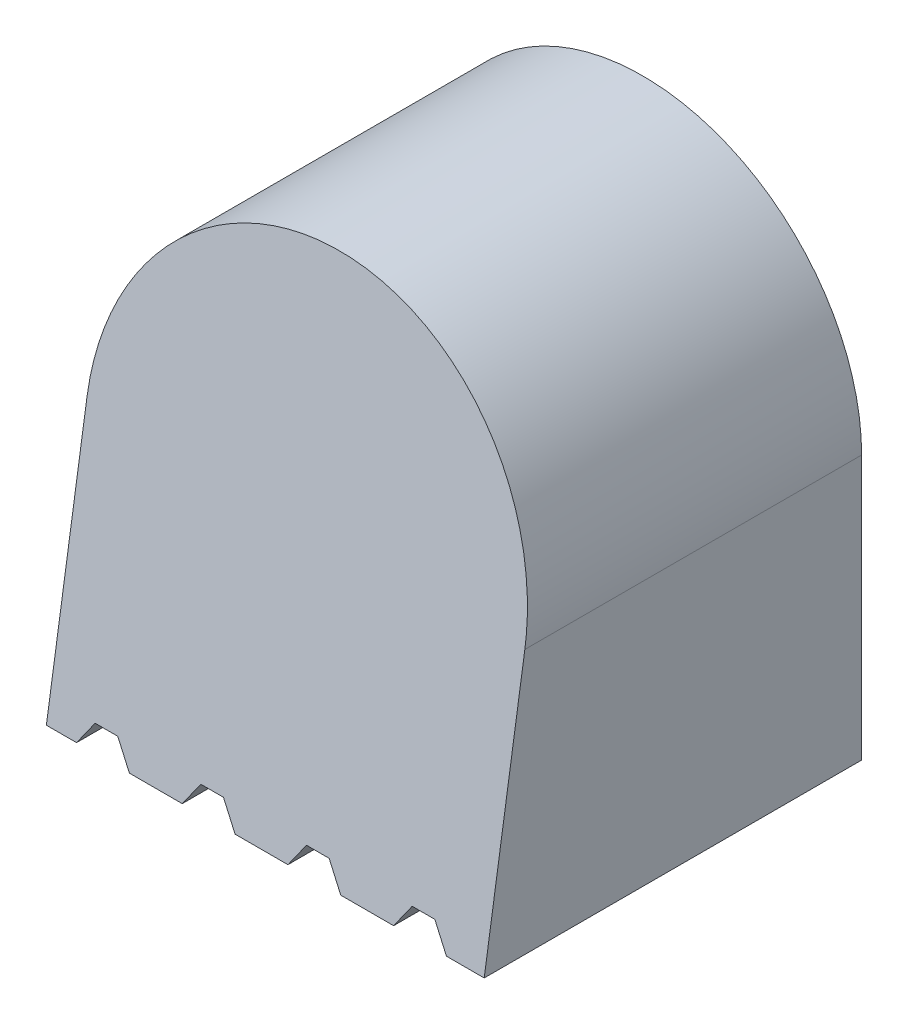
ISO-10303-21;
HEADER;
FILE_DESCRIPTION(('STEP AP214'),'2;1');
FILE_NAME('part.step','',(''),(''),'','','');
FILE_SCHEMA(('AUTOMOTIVE_DESIGN { 1 0 10303 214 1 1 1 1 }'));
ENDSEC;
DATA;
#1=APPLICATION_CONTEXT('core data for automotive mechanical design processes');
#2=APPLICATION_PROTOCOL_DEFINITION('international standard','automotive_design',2000,#1);
#3=PRODUCT_CONTEXT('',#1,'mechanical');
#4=PRODUCT('Part','Part','',(#3));
#5=PRODUCT_RELATED_PRODUCT_CATEGORY('part','',(#4));
#6=PRODUCT_DEFINITION_FORMATION('','',#4);
#7=PRODUCT_DEFINITION_CONTEXT('part definition',#1,'design');
#8=PRODUCT_DEFINITION('design','',#6,#7);
#9=PRODUCT_DEFINITION_SHAPE('','',#8);
#10=(LENGTH_UNIT() NAMED_UNIT(*) SI_UNIT(.MILLI.,.METRE.));
#11=(NAMED_UNIT(*) PLANE_ANGLE_UNIT() SI_UNIT($,.RADIAN.));
#12=(NAMED_UNIT(*) SI_UNIT($,.STERADIAN.) SOLID_ANGLE_UNIT());
#13=UNCERTAINTY_MEASURE_WITH_UNIT(LENGTH_MEASURE(1.E-05),#10,'distance_accuracy_value','');
#14=(GEOMETRIC_REPRESENTATION_CONTEXT(3) GLOBAL_UNCERTAINTY_ASSIGNED_CONTEXT((#13)) GLOBAL_UNIT_ASSIGNED_CONTEXT((#10,
#11,#12)) REPRESENTATION_CONTEXT('',''));
#15=CARTESIAN_POINT('',(0.,0.,0.));
#16=DIRECTION('',(0.,0.,1.));
#17=DIRECTION('',(1.,0.,0.));
#18=AXIS2_PLACEMENT_3D('',#15,#16,#17);
#19=CARTESIAN_POINT('',(0.,0.,50.));
#20=DIRECTION('',(0.,1.,0.));
#21=DIRECTION('',(0.,0.,1.));
#22=AXIS2_PLACEMENT_3D('',#19,#20,#21);
#23=PLANE('',#22);
#24=DIRECTION('',(1.,0.,0.));
#25=VECTOR('',#24,1.);
#26=CARTESIAN_POINT('',(0.,0.,50.));
#27=LINE('',#26,#25);
#28=CARTESIAN_POINT('',(11.,0.,50.));
#29=VERTEX_POINT('',#28);
#30=CARTESIAN_POINT('',(18.,0.,50.));
#31=VERTEX_POINT('',#30);
#32=EDGE_CURVE('E529',#29,#31,#27,.T.);
#33=ORIENTED_EDGE('',*,*,#32,.F.);
#34=DIRECTION('',(0.,0.,-1.));
#35=VECTOR('',#34,1.);
#36=CARTESIAN_POINT('',(11.,0.,50.));
#37=LINE('',#36,#35);
#38=CARTESIAN_POINT('',(11.,0.,0.));
#39=VERTEX_POINT('',#38);
#40=EDGE_CURVE('E439',#29,#39,#37,.T.);
#41=ORIENTED_EDGE('',*,*,#40,.T.);
#42=DIRECTION('',(1.,0.,0.));
#43=VECTOR('',#42,1.);
#44=CARTESIAN_POINT('',(0.,0.,0.));
#45=LINE('',#44,#43);
#46=CARTESIAN_POINT('',(18.,0.,0.));
#47=VERTEX_POINT('',#46);
#48=EDGE_CURVE('E518',#39,#47,#45,.T.);
#49=ORIENTED_EDGE('',*,*,#48,.T.);
#50=DIRECTION('',(0.,0.,-1.));
#51=VECTOR('',#50,1.);
#52=CARTESIAN_POINT('',(18.,0.,50.));
#53=LINE('',#52,#51);
#54=EDGE_CURVE('E462',#31,#47,#53,.T.);
#55=ORIENTED_EDGE('',*,*,#54,.F.);
#56=EDGE_LOOP('',(#33,#41,#49,#55));
#57=FACE_BOUND('',#56,.T.);
#58=ADVANCED_FACE('F30',(#57),#23,.F.);
#59=CARTESIAN_POINT('',(25.,0.,50.));
#60=VERTEX_POINT('',#59);
#61=CARTESIAN_POINT('',(32.,0.,50.));
#62=VERTEX_POINT('',#61);
#63=EDGE_CURVE('E652',#60,#62,#27,.T.);
#64=ORIENTED_EDGE('',*,*,#63,.F.);
#65=DIRECTION('',(0.,0.,-1.));
#66=VECTOR('',#65,1.);
#67=CARTESIAN_POINT('',(25.,0.,50.));
#68=LINE('',#67,#66);
#69=CARTESIAN_POINT('',(25.,0.,0.));
#70=VERTEX_POINT('',#69);
#71=EDGE_CURVE('E456',#60,#70,#68,.T.);
#72=ORIENTED_EDGE('',*,*,#71,.T.);
#73=CARTESIAN_POINT('',(32.,0.,0.));
#74=VERTEX_POINT('',#73);
#75=EDGE_CURVE('E586',#70,#74,#45,.T.);
#76=ORIENTED_EDGE('',*,*,#75,.T.);
#77=DIRECTION('',(0.,0.,-1.));
#78=VECTOR('',#77,1.);
#79=CARTESIAN_POINT('',(32.,0.,50.));
#80=LINE('',#79,#78);
#81=EDGE_CURVE('E480',#62,#74,#80,.T.);
#82=ORIENTED_EDGE('',*,*,#81,.F.);
#83=EDGE_LOOP('',(#64,#72,#76,#82));
#84=FACE_BOUND('',#83,.T.);
#85=ADVANCED_FACE('F632',(#84),#23,.F.);
#86=CARTESIAN_POINT('',(39.,0.,50.));
#87=VERTEX_POINT('',#86);
#88=CARTESIAN_POINT('',(46.,0.,50.));
#89=VERTEX_POINT('',#88);
#90=EDGE_CURVE('E650',#87,#89,#27,.T.);
#91=ORIENTED_EDGE('',*,*,#90,.F.);
#92=DIRECTION('',(0.,0.,-1.));
#93=VECTOR('',#92,1.);
#94=CARTESIAN_POINT('',(39.,0.,50.));
#95=LINE('',#94,#93);
#96=CARTESIAN_POINT('',(39.,0.,0.));
#97=VERTEX_POINT('',#96);
#98=EDGE_CURVE('E474',#87,#97,#95,.T.);
#99=ORIENTED_EDGE('',*,*,#98,.T.);
#100=CARTESIAN_POINT('',(46.,0.,0.));
#101=VERTEX_POINT('',#100);
#102=EDGE_CURVE('E587',#97,#101,#45,.T.);
#103=ORIENTED_EDGE('',*,*,#102,.T.);
#104=DIRECTION('',(0.,0.,-1.));
#105=VECTOR('',#104,1.);
#106=CARTESIAN_POINT('',(46.,0.,50.));
#107=LINE('',#106,#105);
#108=EDGE_CURVE('E492',#89,#101,#107,.T.);
#109=ORIENTED_EDGE('',*,*,#108,.F.);
#110=EDGE_LOOP('',(#91,#99,#103,#109));
#111=FACE_BOUND('',#110,.T.);
#112=ADVANCED_FACE('F636',(#111),#23,.F.);
#113=CARTESIAN_POINT('',(53.,0.,50.));
#114=VERTEX_POINT('',#113);
#115=CARTESIAN_POINT('',(58.,0.,50.));
#116=VERTEX_POINT('',#115);
#117=EDGE_CURVE('E524',#114,#116,#27,.T.);
#118=ORIENTED_EDGE('',*,*,#117,.F.);
#119=DIRECTION('',(0.,0.,-1.));
#120=VECTOR('',#119,1.);
#121=CARTESIAN_POINT('',(53.,0.,50.));
#122=LINE('',#121,#120);
#123=CARTESIAN_POINT('',(53.,0.,0.));
#124=VERTEX_POINT('',#123);
#125=EDGE_CURVE('E493',#114,#124,#122,.T.);
#126=ORIENTED_EDGE('',*,*,#125,.T.);
#127=CARTESIAN_POINT('',(58.,0.,0.));
#128=VERTEX_POINT('',#127);
#129=EDGE_CURVE('E513',#124,#128,#45,.T.);
#130=ORIENTED_EDGE('',*,*,#129,.T.);
#131=DIRECTION('',(0.,0.,-1.));
#132=VECTOR('',#131,1.);
#133=CARTESIAN_POINT('',(58.,0.,50.));
#134=LINE('',#133,#132);
#135=EDGE_CURVE('E533',#116,#128,#134,.T.);
#136=ORIENTED_EDGE('',*,*,#135,.F.);
#137=EDGE_LOOP('',(#118,#126,#130,#136));
#138=FACE_BOUND('',#137,.T.);
#139=ADVANCED_FACE('F598',(#138),#23,.F.);
#140=CARTESIAN_POINT('',(0.,0.,50.));
#141=DIRECTION('',(1.,0.,0.));
#142=DIRECTION('',(0.,0.,-1.));
#143=AXIS2_PLACEMENT_3D('',#140,#141,#142);
#144=PLANE('',#143);
#145=DIRECTION('',(0.,0.,-1.));
#146=VECTOR('',#145,1.);
#147=CARTESIAN_POINT('',(0.,0.,50.));
#148=LINE('',#147,#146);
#149=CARTESIAN_POINT('',(0.,0.,50.));
#150=VERTEX_POINT('',#149);
#151=CARTESIAN_POINT('',(0.,0.,0.));
#152=VERTEX_POINT('',#151);
#153=EDGE_CURVE('E536',#150,#152,#148,.T.);
#154=ORIENTED_EDGE('',*,*,#153,.F.);
#155=DIRECTION('',(0.,0.988371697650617,-0.152057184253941));
#156=VECTOR('',#155,1.);
#157=CARTESIAN_POINT('',(0.,0.,50.));
#158=LINE('',#157,#156);
#159=CARTESIAN_POINT('',(0.,35.,44.6153846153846));
#160=VERTEX_POINT('',#159);
#161=EDGE_CURVE('E504',#150,#160,#158,.T.);
#162=ORIENTED_EDGE('',*,*,#161,.T.);
#163=DIRECTION('',(0.,0.,-1.));
#164=VECTOR('',#163,1.);
#165=CARTESIAN_POINT('',(0.,35.,50.));
#166=LINE('',#165,#164);
#167=CARTESIAN_POINT('',(0.,35.,0.));
#168=VERTEX_POINT('',#167);
#169=EDGE_CURVE('E528',#160,#168,#166,.T.);
#170=ORIENTED_EDGE('',*,*,#169,.T.);
#171=DIRECTION('',(0.,-1.,0.));
#172=VECTOR('',#171,1.);
#173=CARTESIAN_POINT('',(0.,0.,0.));
#174=LINE('',#173,#172);
#175=EDGE_CURVE('E510',#168,#152,#174,.T.);
#176=ORIENTED_EDGE('',*,*,#175,.T.);
#177=EDGE_LOOP('',(#154,#162,#170,#176));
#178=FACE_BOUND('',#177,.T.);
#179=ADVANCED_FACE('F32',(#178),#144,.F.);
#180=CARTESIAN_POINT('',(4.,0.,0.));
#181=VERTEX_POINT('',#180);
#182=EDGE_CURVE('E514',#152,#181,#45,.T.);
#183=ORIENTED_EDGE('',*,*,#182,.T.);
#184=DIRECTION('',(0.,0.,-1.));
#185=VECTOR('',#184,1.);
#186=CARTESIAN_POINT('',(4.,0.,50.));
#187=LINE('',#186,#185);
#188=CARTESIAN_POINT('',(4.,0.,50.));
#189=VERTEX_POINT('',#188);
#190=EDGE_CURVE('E445',#189,#181,#187,.T.);
#191=ORIENTED_EDGE('',*,*,#190,.F.);
#192=EDGE_CURVE('E525',#150,#189,#27,.T.);
#193=ORIENTED_EDGE('',*,*,#192,.F.);
#194=ORIENTED_EDGE('',*,*,#153,.T.);
#195=EDGE_LOOP('',(#183,#191,#193,#194));
#196=FACE_BOUND('',#195,.T.);
#197=ADVANCED_FACE('F614',(#196),#23,.F.);
#198=CARTESIAN_POINT('',(58.,0.,50.));
#199=DIRECTION('',(-1.,0.,0.));
#200=DIRECTION('',(0.,0.,1.));
#201=AXIS2_PLACEMENT_3D('',#198,#199,#200);
#202=PLANE('',#201);
#203=DIRECTION('',(0.,0.,-1.));
#204=VECTOR('',#203,1.);
#205=CARTESIAN_POINT('',(58.,35.,50.));
#206=LINE('',#205,#204);
#207=CARTESIAN_POINT('',(58.,35.,44.6153846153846));
#208=VERTEX_POINT('',#207);
#209=CARTESIAN_POINT('',(58.,35.,0.));
#210=VERTEX_POINT('',#209);
#211=EDGE_CURVE('E531',#208,#210,#206,.T.);
#212=ORIENTED_EDGE('',*,*,#211,.F.);
#213=DIRECTION('',(0.,0.988371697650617,-0.152057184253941));
#214=VECTOR('',#213,1.);
#215=CARTESIAN_POINT('',(58.,0.,50.));
#216=LINE('',#215,#214);
#217=EDGE_CURVE('E496',#116,#208,#216,.T.);
#218=ORIENTED_EDGE('',*,*,#217,.F.);
#219=ORIENTED_EDGE('',*,*,#135,.T.);
#220=DIRECTION('',(0.,1.,0.));
#221=VECTOR('',#220,1.);
#222=CARTESIAN_POINT('',(58.,0.,0.));
#223=LINE('',#222,#221);
#224=EDGE_CURVE('E517',#128,#210,#223,.T.);
#225=ORIENTED_EDGE('',*,*,#224,.T.);
#226=EDGE_LOOP('',(#212,#218,#219,#225));
#227=FACE_BOUND('',#226,.T.);
#228=ADVANCED_FACE('F604',(#227),#202,.F.);
#229=CARTESIAN_POINT('',(29.,35.,50.));
#230=DIRECTION('',(0.,0.,-1.));
#231=DIRECTION('',(-1.,0.,0.));
#232=AXIS2_PLACEMENT_3D('',#229,#230,#231);
#233=CYLINDRICAL_SURFACE('',#232,29.);
#234=ORIENTED_EDGE('',*,*,#169,.F.);
#235=CARTESIAN_POINT('',(29.,35.,44.6153846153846));
#236=DIRECTION('',(0.,-0.152057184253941,-0.988371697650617));
#237=DIRECTION('',(0.,0.988371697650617,-0.152057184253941));
#238=AXIS2_PLACEMENT_3D('',#235,#236,#237);
#239=ELLIPSE('',#238,29.3411882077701,29.);
#240=EDGE_CURVE('E507',#160,#208,#239,.T.);
#241=ORIENTED_EDGE('',*,*,#240,.T.);
#242=ORIENTED_EDGE('',*,*,#211,.T.);
#243=CARTESIAN_POINT('',(29.,35.,0.));
#244=DIRECTION('',(0.,0.,1.));
#245=DIRECTION('',(-1.,0.,0.));
#246=AXIS2_PLACEMENT_3D('',#243,#244,#245);
#247=CIRCLE('',#246,29.);
#248=EDGE_CURVE('E521',#210,#168,#247,.T.);
#249=ORIENTED_EDGE('',*,*,#248,.T.);
#250=EDGE_LOOP('',(#234,#241,#242,#249));
#251=FACE_BOUND('',#250,.T.);
#252=ADVANCED_FACE('F609',(#251),#233,.T.);
#253=CARTESIAN_POINT('',(29.,35.,0.));
#254=DIRECTION('',(0.,0.,-1.));
#255=DIRECTION('',(-1.,0.,0.));
#256=AXIS2_PLACEMENT_3D('',#253,#254,#255);
#257=PLANE('',#256);
#258=DIRECTION('',(-1.,0.,0.));
#259=VECTOR('',#258,1.);
#260=CARTESIAN_POINT('',(12.0990365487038,5.5,0.));
#261=LINE('',#260,#259);
#262=CARTESIAN_POINT('',(17.0990365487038,5.5,0.));
#263=VERTEX_POINT('',#262);
#264=CARTESIAN_POINT('',(12.0990365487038,5.5,0.));
#265=VERTEX_POINT('',#264);
#266=EDGE_CURVE('E45',#263,#265,#261,.T.);
#267=ORIENTED_EDGE('',*,*,#266,.F.);
#268=DIRECTION('',(0.,-1.,0.));
#269=VECTOR('',#268,1.);
#270=CARTESIAN_POINT('',(17.0990365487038,5.5,0.));
#271=LINE('',#270,#269);
#272=CARTESIAN_POINT('',(17.0990365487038,10.7643430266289,0.));
#273=VERTEX_POINT('',#272);
#274=EDGE_CURVE('E297',#273,#263,#271,.T.);
#275=ORIENTED_EDGE('',*,*,#274,.F.);
#276=CARTESIAN_POINT('',(29.,35.,0.));
#277=DIRECTION('',(0.,0.,1.));
#278=DIRECTION('',(1.,0.,0.));
#279=AXIS2_PLACEMENT_3D('',#276,#277,#278);
#280=CIRCLE('',#279,27.);
#281=CARTESIAN_POINT('',(12.0990365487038,13.943945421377,0.));
#282=VERTEX_POINT('',#281);
#283=EDGE_CURVE('E279',#282,#273,#280,.T.);
#284=ORIENTED_EDGE('',*,*,#283,.F.);
#285=DIRECTION('',(0.,1.,0.));
#286=VECTOR('',#285,1.);
#287=CARTESIAN_POINT('',(12.0990365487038,13.943945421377,0.));
#288=LINE('',#287,#286);
#289=EDGE_CURVE('E290',#265,#282,#288,.T.);
#290=ORIENTED_EDGE('',*,*,#289,.F.);
#291=EDGE_LOOP('',(#267,#275,#284,#290));
#292=FACE_BOUND('',#291,.T.);
#293=CARTESIAN_POINT('',(29.,35.,0.));
#294=DIRECTION('',(0.,0.,1.));
#295=DIRECTION('',(-1.,0.,0.));
#296=AXIS2_PLACEMENT_3D('',#293,#294,#295);
#297=CIRCLE('',#296,27.);
#298=CARTESIAN_POINT('',(40.9009634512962,10.7643430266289,0.));
#299=VERTEX_POINT('',#298);
#300=CARTESIAN_POINT('',(45.9009634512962,13.943945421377,0.));
#301=VERTEX_POINT('',#300);
#302=EDGE_CURVE('E53',#299,#301,#297,.T.);
#303=ORIENTED_EDGE('',*,*,#302,.F.);
#304=DIRECTION('',(0.,1.,0.));
#305=VECTOR('',#304,1.);
#306=CARTESIAN_POINT('',(40.9009634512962,5.5,0.));
#307=LINE('',#306,#305);
#308=CARTESIAN_POINT('',(40.9009634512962,5.5,0.));
#309=VERTEX_POINT('',#308);
#310=EDGE_CURVE('E322',#309,#299,#307,.T.);
#311=ORIENTED_EDGE('',*,*,#310,.F.);
#312=DIRECTION('',(-1.,0.,0.));
#313=VECTOR('',#312,1.);
#314=CARTESIAN_POINT('',(45.9009634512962,5.5,0.));
#315=LINE('',#314,#313);
#316=CARTESIAN_POINT('',(45.9009634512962,5.5,0.));
#317=VERTEX_POINT('',#316);
#318=EDGE_CURVE('E319',#317,#309,#315,.T.);
#319=ORIENTED_EDGE('',*,*,#318,.F.);
#320=DIRECTION('',(0.,-1.,0.));
#321=VECTOR('',#320,1.);
#322=CARTESIAN_POINT('',(45.9009634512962,13.943945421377,0.));
#323=LINE('',#322,#321);
#324=EDGE_CURVE('E316',#301,#317,#323,.T.);
#325=ORIENTED_EDGE('',*,*,#324,.F.);
#326=EDGE_LOOP('',(#303,#311,#319,#325));
#327=FACE_BOUND('',#326,.T.);
#328=CARTESIAN_POINT('',(29.,35.,0.));
#329=DIRECTION('',(0.,0.,1.));
#330=DIRECTION('',(-1.,0.,0.));
#331=AXIS2_PLACEMENT_3D('',#328,#329,#330);
#332=CIRCLE('',#331,27.);
#333=CARTESIAN_POINT('',(49.9009634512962,17.9076120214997,0.));
#334=VERTEX_POINT('',#333);
#335=CARTESIAN_POINT('',(51.1076909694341,19.5,0.));
#336=VERTEX_POINT('',#335);
#337=EDGE_CURVE('E340',#334,#336,#332,.T.);
#338=ORIENTED_EDGE('',*,*,#337,.F.);
#339=DIRECTION('',(0.,1.,0.));
#340=VECTOR('',#339,1.);
#341=CARTESIAN_POINT('',(49.9009634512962,5.5,0.));
#342=LINE('',#341,#340);
#343=CARTESIAN_POINT('',(49.9009634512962,5.5,0.));
#344=VERTEX_POINT('',#343);
#345=EDGE_CURVE('E356',#344,#334,#342,.T.);
#346=ORIENTED_EDGE('',*,*,#345,.F.);
#347=DIRECTION('',(-1.,0.,0.));
#348=VECTOR('',#347,1.);
#349=CARTESIAN_POINT('',(54.9009634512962,5.5,0.));
#350=LINE('',#349,#348);
#351=CARTESIAN_POINT('',(54.9009634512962,5.5,0.));
#352=VERTEX_POINT('',#351);
#353=EDGE_CURVE('E353',#352,#344,#350,.T.);
#354=ORIENTED_EDGE('',*,*,#353,.F.);
#355=DIRECTION('',(0.,-1.,0.));
#356=VECTOR('',#355,1.);
#357=CARTESIAN_POINT('',(54.9009634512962,19.5,0.));
#358=LINE('',#357,#356);
#359=CARTESIAN_POINT('',(54.9009634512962,19.5,0.));
#360=VERTEX_POINT('',#359);
#361=EDGE_CURVE('E350',#360,#352,#358,.T.);
#362=ORIENTED_EDGE('',*,*,#361,.F.);
#363=DIRECTION('',(1.,0.,0.));
#364=VECTOR('',#363,1.);
#365=CARTESIAN_POINT('',(51.1076909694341,19.5,0.));
#366=LINE('',#365,#364);
#367=EDGE_CURVE('E347',#336,#360,#366,.T.);
#368=ORIENTED_EDGE('',*,*,#367,.F.);
#369=EDGE_LOOP('',(#338,#346,#354,#362,#368));
#370=FACE_BOUND('',#369,.T.);
#371=CARTESIAN_POINT('',(29.,35.,0.));
#372=DIRECTION('',(0.,0.,1.));
#373=DIRECTION('',(1.,0.,0.));
#374=AXIS2_PLACEMENT_3D('',#371,#372,#373);
#375=CIRCLE('',#374,27.);
#376=CARTESIAN_POINT('',(6.89230903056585,19.5,0.));
#377=VERTEX_POINT('',#376);
#378=CARTESIAN_POINT('',(8.0990365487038,17.9076120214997,0.));
#379=VERTEX_POINT('',#378);
#380=EDGE_CURVE('E377',#377,#379,#375,.T.);
#381=ORIENTED_EDGE('',*,*,#380,.F.);
#382=DIRECTION('',(1.,0.,0.));
#383=VECTOR('',#382,1.);
#384=CARTESIAN_POINT('',(6.89230903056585,19.5,0.));
#385=LINE('',#384,#383);
#386=CARTESIAN_POINT('',(3.0990365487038,19.5,0.));
#387=VERTEX_POINT('',#386);
#388=EDGE_CURVE('E396',#387,#377,#385,.T.);
#389=ORIENTED_EDGE('',*,*,#388,.F.);
#390=DIRECTION('',(0.,1.,0.));
#391=VECTOR('',#390,1.);
#392=CARTESIAN_POINT('',(3.0990365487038,19.5,0.));
#393=LINE('',#392,#391);
#394=CARTESIAN_POINT('',(3.0990365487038,5.5,0.));
#395=VERTEX_POINT('',#394);
#396=EDGE_CURVE('E393',#395,#387,#393,.T.);
#397=ORIENTED_EDGE('',*,*,#396,.F.);
#398=DIRECTION('',(-1.,0.,0.));
#399=VECTOR('',#398,1.);
#400=CARTESIAN_POINT('',(3.0990365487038,5.5,0.));
#401=LINE('',#400,#399);
#402=CARTESIAN_POINT('',(8.0990365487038,5.5,0.));
#403=VERTEX_POINT('',#402);
#404=EDGE_CURVE('E390',#403,#395,#401,.T.);
#405=ORIENTED_EDGE('',*,*,#404,.F.);
#406=DIRECTION('',(0.,-1.,0.));
#407=VECTOR('',#406,1.);
#408=CARTESIAN_POINT('',(8.0990365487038,5.5,0.));
#409=LINE('',#408,#407);
#410=EDGE_CURVE('E387',#379,#403,#409,.T.);
#411=ORIENTED_EDGE('',*,*,#410,.F.);
#412=EDGE_LOOP('',(#381,#389,#397,#405,#411));
#413=FACE_BOUND('',#412,.T.);
#414=CARTESIAN_POINT('',(29.,35.,0.));
#415=DIRECTION('',(0.,0.,-1.));
#416=DIRECTION('',(-1.,0.,0.));
#417=AXIS2_PLACEMENT_3D('',#414,#415,#416);
#418=CIRCLE('',#417,25.5);
#419=CARTESIAN_POINT('',(3.5,35.,0.));
#420=VERTEX_POINT('',#419);
#421=EDGE_CURVE('E417',#420,#420,#418,.T.);
#422=ORIENTED_EDGE('',*,*,#421,.F.);
#423=EDGE_LOOP('',(#422));
#424=FACE_BOUND('',#423,.T.);
#425=DIRECTION('',(0.554700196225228,-0.832050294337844,0.));
#426=VECTOR('',#425,1.);
#427=CARTESIAN_POINT('',(11.,0.,0.));
#428=LINE('',#427,#426);
#429=CARTESIAN_POINT('',(9.,3.,0.));
#430=VERTEX_POINT('',#429);
#431=EDGE_CURVE('E431',#430,#39,#428,.T.);
#432=ORIENTED_EDGE('',*,*,#431,.F.);
#433=DIRECTION('',(1.,0.,0.));
#434=VECTOR('',#433,1.);
#435=CARTESIAN_POINT('',(9.,3.,0.));
#436=LINE('',#435,#434);
#437=CARTESIAN_POINT('',(6.,3.,0.));
#438=VERTEX_POINT('',#437);
#439=EDGE_CURVE('E436',#438,#430,#436,.T.);
#440=ORIENTED_EDGE('',*,*,#439,.F.);
#441=DIRECTION('',(0.554700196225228,0.832050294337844,0.));
#442=VECTOR('',#441,1.);
#443=CARTESIAN_POINT('',(4.,0.,0.));
#444=LINE('',#443,#442);
#445=EDGE_CURVE('E433',#181,#438,#444,.T.);
#446=ORIENTED_EDGE('',*,*,#445,.F.);
#447=ORIENTED_EDGE('',*,*,#182,.F.);
#448=ORIENTED_EDGE('',*,*,#175,.F.);
#449=ORIENTED_EDGE('',*,*,#248,.F.);
#450=ORIENTED_EDGE('',*,*,#224,.F.);
#451=ORIENTED_EDGE('',*,*,#129,.F.);
#452=DIRECTION('',(0.554700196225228,-0.832050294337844,0.));
#453=VECTOR('',#452,1.);
#454=CARTESIAN_POINT('',(53.,0.,0.));
#455=LINE('',#454,#453);
#456=CARTESIAN_POINT('',(51.,3.,0.));
#457=VERTEX_POINT('',#456);
#458=EDGE_CURVE('E490',#457,#124,#455,.T.);
#459=ORIENTED_EDGE('',*,*,#458,.F.);
#460=DIRECTION('',(1.,0.,0.));
#461=VECTOR('',#460,1.);
#462=CARTESIAN_POINT('',(51.,3.,0.));
#463=LINE('',#462,#461);
#464=CARTESIAN_POINT('',(48.,3.,0.));
#465=VERTEX_POINT('',#464);
#466=EDGE_CURVE('E487',#465,#457,#463,.T.);
#467=ORIENTED_EDGE('',*,*,#466,.F.);
#468=DIRECTION('',(0.554700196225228,0.832050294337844,0.));
#469=VECTOR('',#468,1.);
#470=CARTESIAN_POINT('',(46.,0.,0.));
#471=LINE('',#470,#469);
#472=EDGE_CURVE('E477',#101,#465,#471,.T.);
#473=ORIENTED_EDGE('',*,*,#472,.F.);
#474=ORIENTED_EDGE('',*,*,#102,.F.);
#475=DIRECTION('',(0.554700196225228,-0.832050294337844,0.));
#476=VECTOR('',#475,1.);
#477=CARTESIAN_POINT('',(39.,0.,0.));
#478=LINE('',#477,#476);
#479=CARTESIAN_POINT('',(37.,3.,0.));
#480=VERTEX_POINT('',#479);
#481=EDGE_CURVE('E459',#480,#97,#478,.T.);
#482=ORIENTED_EDGE('',*,*,#481,.F.);
#483=DIRECTION('',(1.,0.,0.));
#484=VECTOR('',#483,1.);
#485=CARTESIAN_POINT('',(37.,3.,0.));
#486=LINE('',#485,#484);
#487=CARTESIAN_POINT('',(34.,3.,0.));
#488=VERTEX_POINT('',#487);
#489=EDGE_CURVE('E471',#488,#480,#486,.T.);
#490=ORIENTED_EDGE('',*,*,#489,.F.);
#491=DIRECTION('',(0.554700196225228,0.832050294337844,0.));
#492=VECTOR('',#491,1.);
#493=CARTESIAN_POINT('',(32.,0.,0.));
#494=LINE('',#493,#492);
#495=EDGE_CURVE('E468',#74,#488,#494,.T.);
#496=ORIENTED_EDGE('',*,*,#495,.F.);
#497=ORIENTED_EDGE('',*,*,#75,.F.);
#498=DIRECTION('',(0.554700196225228,-0.832050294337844,0.));
#499=VECTOR('',#498,1.);
#500=CARTESIAN_POINT('',(25.,0.,0.));
#501=LINE('',#500,#499);
#502=CARTESIAN_POINT('',(23.,3.,0.));
#503=VERTEX_POINT('',#502);
#504=EDGE_CURVE('E442',#503,#70,#501,.T.);
#505=ORIENTED_EDGE('',*,*,#504,.F.);
#506=DIRECTION('',(1.,0.,0.));
#507=VECTOR('',#506,1.);
#508=CARTESIAN_POINT('',(23.,3.,0.));
#509=LINE('',#508,#507);
#510=CARTESIAN_POINT('',(20.,3.,0.));
#511=VERTEX_POINT('',#510);
#512=EDGE_CURVE('E453',#511,#503,#509,.T.);
#513=ORIENTED_EDGE('',*,*,#512,.F.);
#514=DIRECTION('',(0.554700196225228,0.832050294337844,0.));
#515=VECTOR('',#514,1.);
#516=CARTESIAN_POINT('',(18.,0.,0.));
#517=LINE('',#516,#515);
#518=EDGE_CURVE('E450',#47,#511,#517,.T.);
#519=ORIENTED_EDGE('',*,*,#518,.F.);
#520=ORIENTED_EDGE('',*,*,#48,.F.);
#521=EDGE_LOOP('',(#432,#440,#446,#447,#448,#449,#450,#451,#459,#467,#473,#474,#482,#490,#496,
#497,#505,#513,#519,#520));
#522=FACE_BOUND('',#521,.T.);
#523=ADVANCED_FACE('F294',(#292,#327,#370,#413,#424,#522),#257,.T.);
#524=CARTESIAN_POINT('',(0.,0.,50.));
#525=DIRECTION('',(0.,-0.152057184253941,-0.988371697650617));
#526=DIRECTION('',(0.,0.988371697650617,-0.152057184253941));
#527=AXIS2_PLACEMENT_3D('',#524,#525,#526);
#528=PLANE('',#527);
#529=DIRECTION('',(1.,0.,0.));
#530=VECTOR('',#529,1.);
#531=CARTESIAN_POINT('',(0.,3.,49.5384615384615));
#532=LINE('',#531,#530);
#533=CARTESIAN_POINT('',(6.,3.,49.5384615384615));
#534=VERTEX_POINT('',#533);
#535=CARTESIAN_POINT('',(9.,3.,49.5384615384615));
#536=VERTEX_POINT('',#535);
#537=EDGE_CURVE('E38',#534,#536,#532,.T.);
#538=ORIENTED_EDGE('',*,*,#537,.T.);
#539=DIRECTION('',(0.550210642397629,-0.825315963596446,0.126971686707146));
#540=VECTOR('',#539,1.);
#541=CARTESIAN_POINT('',(7.66995073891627,4.99507389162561,49.2315270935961));
#542=LINE('',#541,#540);
#543=EDGE_CURVE('E11',#536,#29,#542,.T.);
#544=ORIENTED_EDGE('',*,*,#543,.T.);
#545=ORIENTED_EDGE('',*,*,#32,.T.);
#546=DIRECTION('',(0.550210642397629,0.825315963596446,-0.126971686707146));
#547=VECTOR('',#546,1.);
#548=CARTESIAN_POINT('',(12.550828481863,-8.17375727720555,51.2575011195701));
#549=LINE('',#548,#547);
#550=CARTESIAN_POINT('',(20.,3.,49.5384615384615));
#551=VERTEX_POINT('',#550);
#552=EDGE_CURVE('E557',#31,#551,#549,.T.);
#553=ORIENTED_EDGE('',*,*,#552,.T.);
#554=DIRECTION('',(1.,0.,0.));
#555=VECTOR('',#554,1.);
#556=CARTESIAN_POINT('',(0.,3.,49.5384615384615));
#557=LINE('',#556,#555);
#558=CARTESIAN_POINT('',(23.,3.,49.5384615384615));
#559=VERTEX_POINT('',#558);
#560=EDGE_CURVE('E560',#551,#559,#557,.T.);
#561=ORIENTED_EDGE('',*,*,#560,.T.);
#562=DIRECTION('',(0.550210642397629,-0.825315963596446,0.126971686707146));
#563=VECTOR('',#562,1.);
#564=CARTESIAN_POINT('',(17.4317062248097,11.3524406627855,48.2534706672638));
#565=LINE('',#564,#563);
#566=EDGE_CURVE('E563',#559,#60,#565,.T.);
#567=ORIENTED_EDGE('',*,*,#566,.T.);
#568=ORIENTED_EDGE('',*,*,#63,.T.);
#569=DIRECTION('',(0.550210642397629,0.825315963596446,-0.126971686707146));
#570=VECTOR('',#569,1.);
#571=CARTESIAN_POINT('',(22.3125839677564,-14.5311240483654,52.2355575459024));
#572=LINE('',#571,#570);
#573=CARTESIAN_POINT('',(34.,3.,49.5384615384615));
#574=VERTEX_POINT('',#573);
#575=EDGE_CURVE('E548',#62,#574,#572,.T.);
#576=ORIENTED_EDGE('',*,*,#575,.T.);
#577=DIRECTION('',(1.,0.,0.));
#578=VECTOR('',#577,1.);
#579=CARTESIAN_POINT('',(0.,3.00000000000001,49.5384615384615));
#580=LINE('',#579,#578);
#581=CARTESIAN_POINT('',(37.,3.,49.5384615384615));
#582=VERTEX_POINT('',#581);
#583=EDGE_CURVE('E551',#574,#582,#580,.T.);
#584=ORIENTED_EDGE('',*,*,#583,.T.);
#585=DIRECTION('',(0.550210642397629,-0.825315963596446,0.126971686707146));
#586=VECTOR('',#585,1.);
#587=CARTESIAN_POINT('',(27.1934617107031,17.7098074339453,47.2754142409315));
#588=LINE('',#587,#586);
#589=EDGE_CURVE('E554',#582,#87,#588,.T.);
#590=ORIENTED_EDGE('',*,*,#589,.T.);
#591=ORIENTED_EDGE('',*,*,#90,.T.);
#592=DIRECTION('',(0.550210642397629,0.825315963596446,-0.126971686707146));
#593=VECTOR('',#592,1.);
#594=CARTESIAN_POINT('',(32.0743394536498,-20.8884908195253,53.2136139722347));
#595=LINE('',#594,#593);
#596=CARTESIAN_POINT('',(48.,3.,49.5384615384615));
#597=VERTEX_POINT('',#596);
#598=EDGE_CURVE('E539',#89,#597,#595,.T.);
#599=ORIENTED_EDGE('',*,*,#598,.T.);
#600=DIRECTION('',(1.,0.,0.));
#601=VECTOR('',#600,1.);
#602=CARTESIAN_POINT('',(0.,3.00000000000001,49.5384615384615));
#603=LINE('',#602,#601);
#604=CARTESIAN_POINT('',(51.,3.,49.5384615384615));
#605=VERTEX_POINT('',#604);
#606=EDGE_CURVE('E542',#597,#605,#603,.T.);
#607=ORIENTED_EDGE('',*,*,#606,.T.);
#608=DIRECTION('',(0.550210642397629,-0.825315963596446,0.126971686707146));
#609=VECTOR('',#608,1.);
#610=CARTESIAN_POINT('',(36.9552171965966,24.0671742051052,46.2973578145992));
#611=LINE('',#610,#609);
#612=EDGE_CURVE('E545',#605,#114,#611,.T.);
#613=ORIENTED_EDGE('',*,*,#612,.T.);
#614=ORIENTED_EDGE('',*,*,#117,.T.);
#615=ORIENTED_EDGE('',*,*,#217,.T.);
#616=ORIENTED_EDGE('',*,*,#240,.F.);
#617=ORIENTED_EDGE('',*,*,#161,.F.);
#618=ORIENTED_EDGE('',*,*,#192,.T.);
#619=DIRECTION('',(0.550210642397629,0.825315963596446,-0.126971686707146));
#620=VECTOR('',#619,1.);
#621=CARTESIAN_POINT('',(2.78907299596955,-1.81639050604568,50.2794446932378));
#622=LINE('',#621,#620);
#623=EDGE_CURVE('E566',#189,#534,#622,.T.);
#624=ORIENTED_EDGE('',*,*,#623,.T.);
#625=EDGE_LOOP('',(#538,#544,#545,#553,#561,#567,#568,#576,#584,#590,#591,#599,#607,#613,#614,
#615,#616,#617,#618,#624));
#626=FACE_BOUND('',#625,.T.);
#627=ADVANCED_FACE('F571',(#626),#528,.F.);
#628=CARTESIAN_POINT('',(53.,0.,50.));
#629=DIRECTION('',(0.832050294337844,0.554700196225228,0.));
#630=DIRECTION('',(-0.554700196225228,0.832050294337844,0.));
#631=AXIS2_PLACEMENT_3D('',#628,#629,#630);
#632=PLANE('',#631);
#633=DIRECTION('',(0.,0.,-1.));
#634=VECTOR('',#633,1.);
#635=CARTESIAN_POINT('',(51.,3.,50.));
#636=LINE('',#635,#634);
#637=EDGE_CURVE('E497',#605,#457,#636,.T.);
#638=ORIENTED_EDGE('',*,*,#637,.T.);
#639=ORIENTED_EDGE('',*,*,#458,.T.);
#640=ORIENTED_EDGE('',*,*,#125,.F.);
#641=ORIENTED_EDGE('',*,*,#612,.F.);
#642=EDGE_LOOP('',(#638,#639,#640,#641));
#643=FACE_BOUND('',#642,.T.);
#644=ADVANCED_FACE('F656',(#643),#632,.F.);
#645=CARTESIAN_POINT('',(51.,3.,50.));
#646=DIRECTION('',(0.,1.,0.));
#647=DIRECTION('',(-1.,0.,0.));
#648=AXIS2_PLACEMENT_3D('',#645,#646,#647);
#649=PLANE('',#648);
#650=DIRECTION('',(0.,0.,-1.));
#651=VECTOR('',#650,1.);
#652=CARTESIAN_POINT('',(48.,3.,50.));
#653=LINE('',#652,#651);
#654=EDGE_CURVE('E499',#597,#465,#653,.T.);
#655=ORIENTED_EDGE('',*,*,#654,.T.);
#656=ORIENTED_EDGE('',*,*,#466,.T.);
#657=ORIENTED_EDGE('',*,*,#637,.F.);
#658=ORIENTED_EDGE('',*,*,#606,.F.);
#659=EDGE_LOOP('',(#655,#656,#657,#658));
#660=FACE_BOUND('',#659,.T.);
#661=ADVANCED_FACE('F658',(#660),#649,.F.);
#662=CARTESIAN_POINT('',(46.,0.,50.));
#663=DIRECTION('',(-0.832050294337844,0.554700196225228,0.));
#664=DIRECTION('',(-0.554700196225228,-0.832050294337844,0.));
#665=AXIS2_PLACEMENT_3D('',#662,#663,#664);
#666=PLANE('',#665);
#667=ORIENTED_EDGE('',*,*,#108,.T.);
#668=ORIENTED_EDGE('',*,*,#472,.T.);
#669=ORIENTED_EDGE('',*,*,#654,.F.);
#670=ORIENTED_EDGE('',*,*,#598,.F.);
#671=EDGE_LOOP('',(#667,#668,#669,#670));
#672=FACE_BOUND('',#671,.T.);
#673=ADVANCED_FACE('F663',(#672),#666,.F.);
#674=CARTESIAN_POINT('',(39.,0.,50.));
#675=DIRECTION('',(0.832050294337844,0.554700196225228,0.));
#676=DIRECTION('',(-0.554700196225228,0.832050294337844,0.));
#677=AXIS2_PLACEMENT_3D('',#674,#675,#676);
#678=PLANE('',#677);
#679=DIRECTION('',(0.,0.,-1.));
#680=VECTOR('',#679,1.);
#681=CARTESIAN_POINT('',(37.,3.,50.));
#682=LINE('',#681,#680);
#683=EDGE_CURVE('E475',#582,#480,#682,.T.);
#684=ORIENTED_EDGE('',*,*,#683,.T.);
#685=ORIENTED_EDGE('',*,*,#481,.T.);
#686=ORIENTED_EDGE('',*,*,#98,.F.);
#687=ORIENTED_EDGE('',*,*,#589,.F.);
#688=EDGE_LOOP('',(#684,#685,#686,#687));
#689=FACE_BOUND('',#688,.T.);
#690=ADVANCED_FACE('F665',(#689),#678,.F.);
#691=CARTESIAN_POINT('',(37.,3.,50.));
#692=DIRECTION('',(0.,1.,0.));
#693=DIRECTION('',(-1.,0.,0.));
#694=AXIS2_PLACEMENT_3D('',#691,#692,#693);
#695=PLANE('',#694);
#696=DIRECTION('',(0.,0.,-1.));
#697=VECTOR('',#696,1.);
#698=CARTESIAN_POINT('',(34.,3.,50.));
#699=LINE('',#698,#697);
#700=EDGE_CURVE('E478',#574,#488,#699,.T.);
#701=ORIENTED_EDGE('',*,*,#700,.T.);
#702=ORIENTED_EDGE('',*,*,#489,.T.);
#703=ORIENTED_EDGE('',*,*,#683,.F.);
#704=ORIENTED_EDGE('',*,*,#583,.F.);
#705=EDGE_LOOP('',(#701,#702,#703,#704));
#706=FACE_BOUND('',#705,.T.);
#707=ADVANCED_FACE('F671',(#706),#695,.F.);
#708=CARTESIAN_POINT('',(32.,0.,50.));
#709=DIRECTION('',(-0.832050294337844,0.554700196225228,0.));
#710=DIRECTION('',(-0.554700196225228,-0.832050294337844,0.));
#711=AXIS2_PLACEMENT_3D('',#708,#709,#710);
#712=PLANE('',#711);
#713=ORIENTED_EDGE('',*,*,#81,.T.);
#714=ORIENTED_EDGE('',*,*,#495,.T.);
#715=ORIENTED_EDGE('',*,*,#700,.F.);
#716=ORIENTED_EDGE('',*,*,#575,.F.);
#717=EDGE_LOOP('',(#713,#714,#715,#716));
#718=FACE_BOUND('',#717,.T.);
#719=ADVANCED_FACE('F722',(#718),#712,.F.);
#720=CARTESIAN_POINT('',(25.,0.,50.));
#721=DIRECTION('',(0.832050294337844,0.554700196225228,0.));
#722=DIRECTION('',(-0.554700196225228,0.832050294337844,0.));
#723=AXIS2_PLACEMENT_3D('',#720,#721,#722);
#724=PLANE('',#723);
#725=DIRECTION('',(0.,0.,-1.));
#726=VECTOR('',#725,1.);
#727=CARTESIAN_POINT('',(23.,3.,50.));
#728=LINE('',#727,#726);
#729=EDGE_CURVE('E457',#559,#503,#728,.T.);
#730=ORIENTED_EDGE('',*,*,#729,.T.);
#731=ORIENTED_EDGE('',*,*,#504,.T.);
#732=ORIENTED_EDGE('',*,*,#71,.F.);
#733=ORIENTED_EDGE('',*,*,#566,.F.);
#734=EDGE_LOOP('',(#730,#731,#732,#733));
#735=FACE_BOUND('',#734,.T.);
#736=ADVANCED_FACE('F732',(#735),#724,.F.);
#737=CARTESIAN_POINT('',(23.,3.,50.));
#738=DIRECTION('',(0.,1.,0.));
#739=DIRECTION('',(-1.,0.,0.));
#740=AXIS2_PLACEMENT_3D('',#737,#738,#739);
#741=PLANE('',#740);
#742=DIRECTION('',(0.,0.,-1.));
#743=VECTOR('',#742,1.);
#744=CARTESIAN_POINT('',(20.,3.,50.));
#745=LINE('',#744,#743);
#746=EDGE_CURVE('E460',#551,#511,#745,.T.);
#747=ORIENTED_EDGE('',*,*,#746,.T.);
#748=ORIENTED_EDGE('',*,*,#512,.T.);
#749=ORIENTED_EDGE('',*,*,#729,.F.);
#750=ORIENTED_EDGE('',*,*,#560,.F.);
#751=EDGE_LOOP('',(#747,#748,#749,#750));
#752=FACE_BOUND('',#751,.T.);
#753=ADVANCED_FACE('F742',(#752),#741,.F.);
#754=CARTESIAN_POINT('',(18.,0.,50.));
#755=DIRECTION('',(-0.832050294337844,0.554700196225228,0.));
#756=DIRECTION('',(-0.554700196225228,-0.832050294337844,0.));
#757=AXIS2_PLACEMENT_3D('',#754,#755,#756);
#758=PLANE('',#757);
#759=ORIENTED_EDGE('',*,*,#54,.T.);
#760=ORIENTED_EDGE('',*,*,#518,.T.);
#761=ORIENTED_EDGE('',*,*,#746,.F.);
#762=ORIENTED_EDGE('',*,*,#552,.F.);
#763=EDGE_LOOP('',(#759,#760,#761,#762));
#764=FACE_BOUND('',#763,.T.);
#765=ADVANCED_FACE('F752',(#764),#758,.F.);
#766=CARTESIAN_POINT('',(11.,0.,50.));
#767=DIRECTION('',(0.832050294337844,0.554700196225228,0.));
#768=DIRECTION('',(-0.554700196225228,0.832050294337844,0.));
#769=AXIS2_PLACEMENT_3D('',#766,#767,#768);
#770=PLANE('',#769);
#771=DIRECTION('',(0.,0.,-1.));
#772=VECTOR('',#771,1.);
#773=CARTESIAN_POINT('',(9.,3.,50.));
#774=LINE('',#773,#772);
#775=EDGE_CURVE('E440',#536,#430,#774,.T.);
#776=ORIENTED_EDGE('',*,*,#775,.T.);
#777=ORIENTED_EDGE('',*,*,#431,.T.);
#778=ORIENTED_EDGE('',*,*,#40,.F.);
#779=ORIENTED_EDGE('',*,*,#543,.F.);
#780=EDGE_LOOP('',(#776,#777,#778,#779));
#781=FACE_BOUND('',#780,.T.);
#782=ADVANCED_FACE('F579',(#781),#770,.F.);
#783=CARTESIAN_POINT('',(9.,3.,50.));
#784=DIRECTION('',(0.,1.,0.));
#785=DIRECTION('',(-1.,0.,0.));
#786=AXIS2_PLACEMENT_3D('',#783,#784,#785);
#787=PLANE('',#786);
#788=DIRECTION('',(0.,0.,-1.));
#789=VECTOR('',#788,1.);
#790=CARTESIAN_POINT('',(6.,3.,50.));
#791=LINE('',#790,#789);
#792=EDGE_CURVE('E443',#534,#438,#791,.T.);
#793=ORIENTED_EDGE('',*,*,#792,.T.);
#794=ORIENTED_EDGE('',*,*,#439,.T.);
#795=ORIENTED_EDGE('',*,*,#775,.F.);
#796=ORIENTED_EDGE('',*,*,#537,.F.);
#797=EDGE_LOOP('',(#793,#794,#795,#796));
#798=FACE_BOUND('',#797,.T.);
#799=ADVANCED_FACE('F575',(#798),#787,.F.);
#800=CARTESIAN_POINT('',(4.,0.,50.));
#801=DIRECTION('',(-0.832050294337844,0.554700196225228,0.));
#802=DIRECTION('',(-0.554700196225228,-0.832050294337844,0.));
#803=AXIS2_PLACEMENT_3D('',#800,#801,#802);
#804=PLANE('',#803);
#805=ORIENTED_EDGE('',*,*,#190,.T.);
#806=ORIENTED_EDGE('',*,*,#445,.T.);
#807=ORIENTED_EDGE('',*,*,#792,.F.);
#808=ORIENTED_EDGE('',*,*,#623,.F.);
#809=EDGE_LOOP('',(#805,#806,#807,#808));
#810=FACE_BOUND('',#809,.T.);
#811=ADVANCED_FACE('F618',(#810),#804,.F.);
#812=CARTESIAN_POINT('',(29.,35.,35.));
#813=DIRECTION('',(0.,0.,-1.));
#814=DIRECTION('',(-1.,0.,0.));
#815=AXIS2_PLACEMENT_3D('',#812,#813,#814);
#816=CYLINDRICAL_SURFACE('',#815,25.5);
#817=CARTESIAN_POINT('',(29.,35.,35.));
#818=DIRECTION('',(0.,0.,-1.));
#819=DIRECTION('',(-1.,0.,0.));
#820=AXIS2_PLACEMENT_3D('',#817,#818,#819);
#821=CIRCLE('',#820,25.5);
#822=CARTESIAN_POINT('',(3.5,35.,35.));
#823=VERTEX_POINT('',#822);
#824=EDGE_CURVE('E428',#823,#823,#821,.T.);
#825=ORIENTED_EDGE('',*,*,#824,.F.);
#826=EDGE_LOOP('',(#825));
#827=FACE_BOUND('',#826,.T.);
#828=ORIENTED_EDGE('',*,*,#421,.T.);
#829=EDGE_LOOP('',(#828));
#830=FACE_BOUND('',#829,.T.);
#831=ADVANCED_FACE('F620',(#827,#830),#816,.F.);
#832=CARTESIAN_POINT('',(29.,35.,35.));
#833=DIRECTION('',(0.,0.,-1.));
#834=DIRECTION('',(-1.,0.,0.));
#835=AXIS2_PLACEMENT_3D('',#832,#833,#834);
#836=PLANE('',#835);
#837=ORIENTED_EDGE('',*,*,#824,.T.);
#838=EDGE_LOOP('',(#837));
#839=FACE_BOUND('',#838,.T.);
#840=ADVANCED_FACE('F626',(#839),#836,.T.);
#841=CARTESIAN_POINT('',(29.,35.,43.));
#842=DIRECTION('',(0.,0.,-1.));
#843=DIRECTION('',(-1.,0.,0.));
#844=AXIS2_PLACEMENT_3D('',#841,#842,#843);
#845=CYLINDRICAL_SURFACE('',#844,27.);
#846=ORIENTED_EDGE('',*,*,#380,.T.);
#847=DIRECTION('',(0.,0.,-1.));
#848=VECTOR('',#847,1.);
#849=CARTESIAN_POINT('',(8.0990365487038,17.9076120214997,43.));
#850=LINE('',#849,#848);
#851=CARTESIAN_POINT('',(8.0990365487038,17.9076120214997,43.));
#852=VERTEX_POINT('',#851);
#853=EDGE_CURVE('E414',#852,#379,#850,.T.);
#854=ORIENTED_EDGE('',*,*,#853,.F.);
#855=CARTESIAN_POINT('',(29.,35.,43.));
#856=DIRECTION('',(0.,0.,1.));
#857=DIRECTION('',(1.,0.,0.));
#858=AXIS2_PLACEMENT_3D('',#855,#856,#857);
#859=CIRCLE('',#858,27.);
#860=CARTESIAN_POINT('',(6.89230903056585,19.5,43.));
#861=VERTEX_POINT('',#860);
#862=EDGE_CURVE('E399',#861,#852,#859,.T.);
#863=ORIENTED_EDGE('',*,*,#862,.F.);
#864=DIRECTION('',(0.,0.,-1.));
#865=VECTOR('',#864,1.);
#866=CARTESIAN_POINT('',(6.89230903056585,19.5,43.));
#867=LINE('',#866,#865);
#868=EDGE_CURVE('E415',#861,#377,#867,.T.);
#869=ORIENTED_EDGE('',*,*,#868,.T.);
#870=EDGE_LOOP('',(#846,#854,#863,#869));
#871=FACE_BOUND('',#870,.T.);
#872=ADVANCED_FACE('F794',(#871),#845,.T.);
#873=CARTESIAN_POINT('',(6.89230903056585,19.5,43.));
#874=DIRECTION('',(0.,1.,0.));
#875=DIRECTION('',(-1.,0.,0.));
#876=AXIS2_PLACEMENT_3D('',#873,#874,#875);
#877=PLANE('',#876);
#878=ORIENTED_EDGE('',*,*,#388,.T.);
#879=ORIENTED_EDGE('',*,*,#868,.F.);
#880=DIRECTION('',(1.,0.,0.));
#881=VECTOR('',#880,1.);
#882=CARTESIAN_POINT('',(6.89230903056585,19.5,43.));
#883=LINE('',#882,#881);
#884=CARTESIAN_POINT('',(3.0990365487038,19.5,43.));
#885=VERTEX_POINT('',#884);
#886=EDGE_CURVE('E411',#885,#861,#883,.T.);
#887=ORIENTED_EDGE('',*,*,#886,.F.);
#888=DIRECTION('',(0.,0.,-1.));
#889=VECTOR('',#888,1.);
#890=CARTESIAN_POINT('',(3.0990365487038,19.5,43.));
#891=LINE('',#890,#889);
#892=EDGE_CURVE('E418',#885,#387,#891,.T.);
#893=ORIENTED_EDGE('',*,*,#892,.T.);
#894=EDGE_LOOP('',(#878,#879,#887,#893));
#895=FACE_BOUND('',#894,.T.);
#896=ADVANCED_FACE('F804',(#895),#877,.F.);
#897=CARTESIAN_POINT('',(3.0990365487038,19.5,43.));
#898=DIRECTION('',(-1.,0.,0.));
#899=DIRECTION('',(0.,0.,1.));
#900=AXIS2_PLACEMENT_3D('',#897,#898,#899);
#901=PLANE('',#900);
#902=ORIENTED_EDGE('',*,*,#396,.T.);
#903=ORIENTED_EDGE('',*,*,#892,.F.);
#904=DIRECTION('',(0.,1.,0.));
#905=VECTOR('',#904,1.);
#906=CARTESIAN_POINT('',(3.0990365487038,19.5,43.));
#907=LINE('',#906,#905);
#908=CARTESIAN_POINT('',(3.0990365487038,5.5,43.));
#909=VERTEX_POINT('',#908);
#910=EDGE_CURVE('E408',#909,#885,#907,.T.);
#911=ORIENTED_EDGE('',*,*,#910,.F.);
#912=DIRECTION('',(0.,0.,-1.));
#913=VECTOR('',#912,1.);
#914=CARTESIAN_POINT('',(3.0990365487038,5.5,43.));
#915=LINE('',#914,#913);
#916=EDGE_CURVE('E420',#909,#395,#915,.T.);
#917=ORIENTED_EDGE('',*,*,#916,.T.);
#918=EDGE_LOOP('',(#902,#903,#911,#917));
#919=FACE_BOUND('',#918,.T.);
#920=ADVANCED_FACE('F814',(#919),#901,.F.);
#921=CARTESIAN_POINT('',(3.0990365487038,5.5,43.));
#922=DIRECTION('',(0.,-1.,0.));
#923=DIRECTION('',(0.,0.,-1.));
#924=AXIS2_PLACEMENT_3D('',#921,#922,#923);
#925=PLANE('',#924);
#926=ORIENTED_EDGE('',*,*,#404,.T.);
#927=ORIENTED_EDGE('',*,*,#916,.F.);
#928=DIRECTION('',(-1.,0.,0.));
#929=VECTOR('',#928,1.);
#930=CARTESIAN_POINT('',(3.0990365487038,5.5,43.));
#931=LINE('',#930,#929);
#932=CARTESIAN_POINT('',(8.0990365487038,5.5,43.));
#933=VERTEX_POINT('',#932);
#934=EDGE_CURVE('E405',#933,#909,#931,.T.);
#935=ORIENTED_EDGE('',*,*,#934,.F.);
#936=DIRECTION('',(0.,0.,-1.));
#937=VECTOR('',#936,1.);
#938=CARTESIAN_POINT('',(8.0990365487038,5.5,43.));
#939=LINE('',#938,#937);
#940=EDGE_CURVE('E422',#933,#403,#939,.T.);
#941=ORIENTED_EDGE('',*,*,#940,.T.);
#942=EDGE_LOOP('',(#926,#927,#935,#941));
#943=FACE_BOUND('',#942,.T.);
#944=ADVANCED_FACE('F824',(#943),#925,.F.);
#945=CARTESIAN_POINT('',(8.0990365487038,5.5,43.));
#946=DIRECTION('',(1.,0.,0.));
#947=DIRECTION('',(0.,0.,-1.));
#948=AXIS2_PLACEMENT_3D('',#945,#946,#947);
#949=PLANE('',#948);
#950=ORIENTED_EDGE('',*,*,#410,.T.);
#951=ORIENTED_EDGE('',*,*,#940,.F.);
#952=DIRECTION('',(0.,-1.,0.));
#953=VECTOR('',#952,1.);
#954=CARTESIAN_POINT('',(8.0990365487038,5.5,43.));
#955=LINE('',#954,#953);
#956=EDGE_CURVE('E402',#852,#933,#955,.T.);
#957=ORIENTED_EDGE('',*,*,#956,.F.);
#958=ORIENTED_EDGE('',*,*,#853,.T.);
#959=EDGE_LOOP('',(#950,#951,#957,#958));
#960=FACE_BOUND('',#959,.T.);
#961=ADVANCED_FACE('F834',(#960),#949,.F.);
#962=CARTESIAN_POINT('',(29.,35.,43.));
#963=DIRECTION('',(0.,0.,1.));
#964=DIRECTION('',(1.,0.,0.));
#965=AXIS2_PLACEMENT_3D('',#962,#963,#964);
#966=PLANE('',#965);
#967=ORIENTED_EDGE('',*,*,#862,.T.);
#968=ORIENTED_EDGE('',*,*,#956,.T.);
#969=ORIENTED_EDGE('',*,*,#934,.T.);
#970=ORIENTED_EDGE('',*,*,#910,.T.);
#971=ORIENTED_EDGE('',*,*,#886,.T.);
#972=EDGE_LOOP('',(#967,#968,#969,#970,#971));
#973=FACE_BOUND('',#972,.T.);
#974=ADVANCED_FACE('F844',(#973),#966,.F.);
#975=CARTESIAN_POINT('',(29.,35.,43.));
#976=DIRECTION('',(0.,0.,-1.));
#977=DIRECTION('',(-1.,0.,0.));
#978=AXIS2_PLACEMENT_3D('',#975,#976,#977);
#979=CYLINDRICAL_SURFACE('',#978,27.);
#980=ORIENTED_EDGE('',*,*,#337,.T.);
#981=DIRECTION('',(0.,0.,-1.));
#982=VECTOR('',#981,1.);
#983=CARTESIAN_POINT('',(51.1076909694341,19.5,43.));
#984=LINE('',#983,#982);
#985=CARTESIAN_POINT('',(51.1076909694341,19.5,43.));
#986=VERTEX_POINT('',#985);
#987=EDGE_CURVE('E374',#986,#336,#984,.T.);
#988=ORIENTED_EDGE('',*,*,#987,.F.);
#989=CARTESIAN_POINT('',(29.,35.,43.));
#990=DIRECTION('',(0.,0.,1.));
#991=DIRECTION('',(-1.,0.,0.));
#992=AXIS2_PLACEMENT_3D('',#989,#990,#991);
#993=CIRCLE('',#992,27.);
#994=CARTESIAN_POINT('',(49.9009634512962,17.9076120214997,43.));
#995=VERTEX_POINT('',#994);
#996=EDGE_CURVE('E359',#995,#986,#993,.T.);
#997=ORIENTED_EDGE('',*,*,#996,.F.);
#998=DIRECTION('',(0.,0.,-1.));
#999=VECTOR('',#998,1.);
#1000=CARTESIAN_POINT('',(49.9009634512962,17.9076120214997,43.));
#1001=LINE('',#1000,#999);
#1002=EDGE_CURVE('E375',#995,#334,#1001,.T.);
#1003=ORIENTED_EDGE('',*,*,#1002,.T.);
#1004=EDGE_LOOP('',(#980,#988,#997,#1003));
#1005=FACE_BOUND('',#1004,.T.);
#1006=ADVANCED_FACE('F854',(#1005),#979,.T.);
#1007=CARTESIAN_POINT('',(49.9009634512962,5.5,43.));
#1008=DIRECTION('',(-1.,0.,0.));
#1009=DIRECTION('',(0.,0.,1.));
#1010=AXIS2_PLACEMENT_3D('',#1007,#1008,#1009);
#1011=PLANE('',#1010);
#1012=ORIENTED_EDGE('',*,*,#345,.T.);
#1013=ORIENTED_EDGE('',*,*,#1002,.F.);
#1014=DIRECTION('',(0.,1.,0.));
#1015=VECTOR('',#1014,1.);
#1016=CARTESIAN_POINT('',(49.9009634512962,5.5,43.));
#1017=LINE('',#1016,#1015);
#1018=CARTESIAN_POINT('',(49.9009634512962,5.5,43.));
#1019=VERTEX_POINT('',#1018);
#1020=EDGE_CURVE('E371',#1019,#995,#1017,.T.);
#1021=ORIENTED_EDGE('',*,*,#1020,.F.);
#1022=DIRECTION('',(0.,0.,-1.));
#1023=VECTOR('',#1022,1.);
#1024=CARTESIAN_POINT('',(49.9009634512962,5.5,43.));
#1025=LINE('',#1024,#1023);
#1026=EDGE_CURVE('E378',#1019,#344,#1025,.T.);
#1027=ORIENTED_EDGE('',*,*,#1026,.T.);
#1028=EDGE_LOOP('',(#1012,#1013,#1021,#1027));
#1029=FACE_BOUND('',#1028,.T.);
#1030=ADVANCED_FACE('F864',(#1029),#1011,.F.);
#1031=CARTESIAN_POINT('',(54.9009634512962,5.5,43.));
#1032=DIRECTION('',(0.,-1.,0.));
#1033=DIRECTION('',(0.,0.,-1.));
#1034=AXIS2_PLACEMENT_3D('',#1031,#1032,#1033);
#1035=PLANE('',#1034);
#1036=ORIENTED_EDGE('',*,*,#353,.T.);
#1037=ORIENTED_EDGE('',*,*,#1026,.F.);
#1038=DIRECTION('',(-1.,0.,0.));
#1039=VECTOR('',#1038,1.);
#1040=CARTESIAN_POINT('',(54.9009634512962,5.5,43.));
#1041=LINE('',#1040,#1039);
#1042=CARTESIAN_POINT('',(54.9009634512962,5.5,43.));
#1043=VERTEX_POINT('',#1042);
#1044=EDGE_CURVE('E368',#1043,#1019,#1041,.T.);
#1045=ORIENTED_EDGE('',*,*,#1044,.F.);
#1046=DIRECTION('',(0.,0.,-1.));
#1047=VECTOR('',#1046,1.);
#1048=CARTESIAN_POINT('',(54.9009634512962,5.5,43.));
#1049=LINE('',#1048,#1047);
#1050=EDGE_CURVE('E380',#1043,#352,#1049,.T.);
#1051=ORIENTED_EDGE('',*,*,#1050,.T.);
#1052=EDGE_LOOP('',(#1036,#1037,#1045,#1051));
#1053=FACE_BOUND('',#1052,.T.);
#1054=ADVANCED_FACE('F874',(#1053),#1035,.F.);
#1055=CARTESIAN_POINT('',(54.9009634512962,19.5,43.));
#1056=DIRECTION('',(1.,0.,0.));
#1057=DIRECTION('',(0.,0.,-1.));
#1058=AXIS2_PLACEMENT_3D('',#1055,#1056,#1057);
#1059=PLANE('',#1058);
#1060=ORIENTED_EDGE('',*,*,#361,.T.);
#1061=ORIENTED_EDGE('',*,*,#1050,.F.);
#1062=DIRECTION('',(0.,-1.,0.));
#1063=VECTOR('',#1062,1.);
#1064=CARTESIAN_POINT('',(54.9009634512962,19.5,43.));
#1065=LINE('',#1064,#1063);
#1066=CARTESIAN_POINT('',(54.9009634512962,19.5,43.));
#1067=VERTEX_POINT('',#1066);
#1068=EDGE_CURVE('E365',#1067,#1043,#1065,.T.);
#1069=ORIENTED_EDGE('',*,*,#1068,.F.);
#1070=DIRECTION('',(0.,0.,-1.));
#1071=VECTOR('',#1070,1.);
#1072=CARTESIAN_POINT('',(54.9009634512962,19.5,43.));
#1073=LINE('',#1072,#1071);
#1074=EDGE_CURVE('E382',#1067,#360,#1073,.T.);
#1075=ORIENTED_EDGE('',*,*,#1074,.T.);
#1076=EDGE_LOOP('',(#1060,#1061,#1069,#1075));
#1077=FACE_BOUND('',#1076,.T.);
#1078=ADVANCED_FACE('F884',(#1077),#1059,.F.);
#1079=CARTESIAN_POINT('',(51.1076909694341,19.5,43.));
#1080=DIRECTION('',(0.,1.,0.));
#1081=DIRECTION('',(-1.,0.,0.));
#1082=AXIS2_PLACEMENT_3D('',#1079,#1080,#1081);
#1083=PLANE('',#1082);
#1084=ORIENTED_EDGE('',*,*,#367,.T.);
#1085=ORIENTED_EDGE('',*,*,#1074,.F.);
#1086=DIRECTION('',(1.,0.,0.));
#1087=VECTOR('',#1086,1.);
#1088=CARTESIAN_POINT('',(51.1076909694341,19.5,43.));
#1089=LINE('',#1088,#1087);
#1090=EDGE_CURVE('E362',#986,#1067,#1089,.T.);
#1091=ORIENTED_EDGE('',*,*,#1090,.F.);
#1092=ORIENTED_EDGE('',*,*,#987,.T.);
#1093=EDGE_LOOP('',(#1084,#1085,#1091,#1092));
#1094=FACE_BOUND('',#1093,.T.);
#1095=ADVANCED_FACE('F894',(#1094),#1083,.F.);
#1096=CARTESIAN_POINT('',(29.,35.,43.));
#1097=DIRECTION('',(0.,0.,-1.));
#1098=DIRECTION('',(-1.,0.,0.));
#1099=AXIS2_PLACEMENT_3D('',#1096,#1097,#1098);
#1100=PLANE('',#1099);
#1101=ORIENTED_EDGE('',*,*,#996,.T.);
#1102=ORIENTED_EDGE('',*,*,#1090,.T.);
#1103=ORIENTED_EDGE('',*,*,#1068,.T.);
#1104=ORIENTED_EDGE('',*,*,#1044,.T.);
#1105=ORIENTED_EDGE('',*,*,#1020,.T.);
#1106=EDGE_LOOP('',(#1101,#1102,#1103,#1104,#1105));
#1107=FACE_BOUND('',#1106,.T.);
#1108=ADVANCED_FACE('F904',(#1107),#1100,.T.);
#1109=CARTESIAN_POINT('',(29.,35.,43.));
#1110=DIRECTION('',(0.,0.,-1.));
#1111=DIRECTION('',(-1.,0.,0.));
#1112=AXIS2_PLACEMENT_3D('',#1109,#1110,#1111);
#1113=CYLINDRICAL_SURFACE('',#1112,27.);
#1114=ORIENTED_EDGE('',*,*,#302,.T.);
#1115=DIRECTION('',(0.,0.,-1.));
#1116=VECTOR('',#1115,1.);
#1117=CARTESIAN_POINT('',(45.9009634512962,13.943945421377,43.));
#1118=LINE('',#1117,#1116);
#1119=CARTESIAN_POINT('',(45.9009634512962,13.943945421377,43.));
#1120=VERTEX_POINT('',#1119);
#1121=EDGE_CURVE('E337',#1120,#301,#1118,.T.);
#1122=ORIENTED_EDGE('',*,*,#1121,.F.);
#1123=CARTESIAN_POINT('',(29.,35.,43.));
#1124=DIRECTION('',(0.,0.,1.));
#1125=DIRECTION('',(-1.,0.,0.));
#1126=AXIS2_PLACEMENT_3D('',#1123,#1124,#1125);
#1127=CIRCLE('',#1126,27.);
#1128=CARTESIAN_POINT('',(40.9009634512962,10.7643430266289,43.));
#1129=VERTEX_POINT('',#1128);
#1130=EDGE_CURVE('E325',#1129,#1120,#1127,.T.);
#1131=ORIENTED_EDGE('',*,*,#1130,.F.);
#1132=DIRECTION('',(0.,0.,-1.));
#1133=VECTOR('',#1132,1.);
#1134=CARTESIAN_POINT('',(40.9009634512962,10.7643430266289,43.));
#1135=LINE('',#1134,#1133);
#1136=EDGE_CURVE('E338',#1129,#299,#1135,.T.);
#1137=ORIENTED_EDGE('',*,*,#1136,.T.);
#1138=EDGE_LOOP('',(#1114,#1122,#1131,#1137));
#1139=FACE_BOUND('',#1138,.T.);
#1140=ADVANCED_FACE('F914',(#1139),#1113,.T.);
#1141=CARTESIAN_POINT('',(40.9009634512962,5.5,43.));
#1142=DIRECTION('',(-1.,0.,0.));
#1143=DIRECTION('',(0.,0.,1.));
#1144=AXIS2_PLACEMENT_3D('',#1141,#1142,#1143);
#1145=PLANE('',#1144);
#1146=ORIENTED_EDGE('',*,*,#310,.T.);
#1147=ORIENTED_EDGE('',*,*,#1136,.F.);
#1148=DIRECTION('',(0.,1.,0.));
#1149=VECTOR('',#1148,1.);
#1150=CARTESIAN_POINT('',(40.9009634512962,5.5,43.));
#1151=LINE('',#1150,#1149);
#1152=CARTESIAN_POINT('',(40.9009634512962,5.5,43.));
#1153=VERTEX_POINT('',#1152);
#1154=EDGE_CURVE('E334',#1153,#1129,#1151,.T.);
#1155=ORIENTED_EDGE('',*,*,#1154,.F.);
#1156=DIRECTION('',(0.,0.,-1.));
#1157=VECTOR('',#1156,1.);
#1158=CARTESIAN_POINT('',(40.9009634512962,5.5,43.));
#1159=LINE('',#1158,#1157);
#1160=EDGE_CURVE('E341',#1153,#309,#1159,.T.);
#1161=ORIENTED_EDGE('',*,*,#1160,.T.);
#1162=EDGE_LOOP('',(#1146,#1147,#1155,#1161));
#1163=FACE_BOUND('',#1162,.T.);
#1164=ADVANCED_FACE('F924',(#1163),#1145,.F.);
#1165=CARTESIAN_POINT('',(45.9009634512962,5.5,43.));
#1166=DIRECTION('',(0.,-1.,0.));
#1167=DIRECTION('',(0.,0.,-1.));
#1168=AXIS2_PLACEMENT_3D('',#1165,#1166,#1167);
#1169=PLANE('',#1168);
#1170=ORIENTED_EDGE('',*,*,#318,.T.);
#1171=ORIENTED_EDGE('',*,*,#1160,.F.);
#1172=DIRECTION('',(-1.,0.,0.));
#1173=VECTOR('',#1172,1.);
#1174=CARTESIAN_POINT('',(45.9009634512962,5.5,43.));
#1175=LINE('',#1174,#1173);
#1176=CARTESIAN_POINT('',(45.9009634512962,5.5,43.));
#1177=VERTEX_POINT('',#1176);
#1178=EDGE_CURVE('E331',#1177,#1153,#1175,.T.);
#1179=ORIENTED_EDGE('',*,*,#1178,.F.);
#1180=DIRECTION('',(0.,0.,-1.));
#1181=VECTOR('',#1180,1.);
#1182=CARTESIAN_POINT('',(45.9009634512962,5.5,43.));
#1183=LINE('',#1182,#1181);
#1184=EDGE_CURVE('E343',#1177,#317,#1183,.T.);
#1185=ORIENTED_EDGE('',*,*,#1184,.T.);
#1186=EDGE_LOOP('',(#1170,#1171,#1179,#1185));
#1187=FACE_BOUND('',#1186,.T.);
#1188=ADVANCED_FACE('F933',(#1187),#1169,.F.);
#1189=CARTESIAN_POINT('',(45.9009634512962,13.943945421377,43.));
#1190=DIRECTION('',(1.,0.,0.));
#1191=DIRECTION('',(0.,0.,-1.));
#1192=AXIS2_PLACEMENT_3D('',#1189,#1190,#1191);
#1193=PLANE('',#1192);
#1194=ORIENTED_EDGE('',*,*,#324,.T.);
#1195=ORIENTED_EDGE('',*,*,#1184,.F.);
#1196=DIRECTION('',(0.,-1.,0.));
#1197=VECTOR('',#1196,1.);
#1198=CARTESIAN_POINT('',(45.9009634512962,13.943945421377,43.));
#1199=LINE('',#1198,#1197);
#1200=EDGE_CURVE('E328',#1120,#1177,#1199,.T.);
#1201=ORIENTED_EDGE('',*,*,#1200,.F.);
#1202=ORIENTED_EDGE('',*,*,#1121,.T.);
#1203=EDGE_LOOP('',(#1194,#1195,#1201,#1202));
#1204=FACE_BOUND('',#1203,.T.);
#1205=ADVANCED_FACE('F943',(#1204),#1193,.F.);
#1206=CARTESIAN_POINT('',(29.,35.,43.));
#1207=DIRECTION('',(0.,0.,-1.));
#1208=DIRECTION('',(-1.,0.,0.));
#1209=AXIS2_PLACEMENT_3D('',#1206,#1207,#1208);
#1210=PLANE('',#1209);
#1211=ORIENTED_EDGE('',*,*,#1130,.T.);
#1212=ORIENTED_EDGE('',*,*,#1200,.T.);
#1213=ORIENTED_EDGE('',*,*,#1178,.T.);
#1214=ORIENTED_EDGE('',*,*,#1154,.T.);
#1215=EDGE_LOOP('',(#1211,#1212,#1213,#1214));
#1216=FACE_BOUND('',#1215,.T.);
#1217=ADVANCED_FACE('F953',(#1216),#1210,.T.);
#1218=CARTESIAN_POINT('',(12.0990365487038,5.5,43.));
#1219=DIRECTION('',(0.,-1.,0.));
#1220=DIRECTION('',(0.,0.,-1.));
#1221=AXIS2_PLACEMENT_3D('',#1218,#1219,#1220);
#1222=PLANE('',#1221);
#1223=ORIENTED_EDGE('',*,*,#266,.T.);
#1224=DIRECTION('',(0.,0.,-1.));
#1225=VECTOR('',#1224,1.);
#1226=CARTESIAN_POINT('',(12.0990365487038,5.5,43.));
#1227=LINE('',#1226,#1225);
#1228=CARTESIAN_POINT('',(12.0990365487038,5.5,43.));
#1229=VERTEX_POINT('',#1228);
#1230=EDGE_CURVE('E287',#1229,#265,#1227,.T.);
#1231=ORIENTED_EDGE('',*,*,#1230,.F.);
#1232=DIRECTION('',(-1.,0.,0.));
#1233=VECTOR('',#1232,1.);
#1234=CARTESIAN_POINT('',(12.0990365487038,5.5,43.));
#1235=LINE('',#1234,#1233);
#1236=CARTESIAN_POINT('',(17.0990365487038,5.5,43.));
#1237=VERTEX_POINT('',#1236);
#1238=EDGE_CURVE('E299',#1237,#1229,#1235,.T.);
#1239=ORIENTED_EDGE('',*,*,#1238,.F.);
#1240=DIRECTION('',(0.,0.,-1.));
#1241=VECTOR('',#1240,1.);
#1242=CARTESIAN_POINT('',(17.0990365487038,5.5,43.));
#1243=LINE('',#1242,#1241);
#1244=EDGE_CURVE('E311',#1237,#263,#1243,.T.);
#1245=ORIENTED_EDGE('',*,*,#1244,.T.);
#1246=EDGE_LOOP('',(#1223,#1231,#1239,#1245));
#1247=FACE_BOUND('',#1246,.T.);
#1248=ADVANCED_FACE('F963',(#1247),#1222,.F.);
#1249=CARTESIAN_POINT('',(17.0990365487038,5.5,43.));
#1250=DIRECTION('',(1.,0.,0.));
#1251=DIRECTION('',(0.,0.,-1.));
#1252=AXIS2_PLACEMENT_3D('',#1249,#1250,#1251);
#1253=PLANE('',#1252);
#1254=ORIENTED_EDGE('',*,*,#274,.T.);
#1255=ORIENTED_EDGE('',*,*,#1244,.F.);
#1256=DIRECTION('',(0.,-1.,0.));
#1257=VECTOR('',#1256,1.);
#1258=CARTESIAN_POINT('',(17.0990365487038,5.5,43.));
#1259=LINE('',#1258,#1257);
#1260=CARTESIAN_POINT('',(17.0990365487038,10.7643430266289,43.));
#1261=VERTEX_POINT('',#1260);
#1262=EDGE_CURVE('E308',#1261,#1237,#1259,.T.);
#1263=ORIENTED_EDGE('',*,*,#1262,.F.);
#1264=DIRECTION('',(0.,0.,-1.));
#1265=VECTOR('',#1264,1.);
#1266=CARTESIAN_POINT('',(17.0990365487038,10.7643430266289,43.));
#1267=LINE('',#1266,#1265);
#1268=EDGE_CURVE('E286',#1261,#273,#1267,.T.);
#1269=ORIENTED_EDGE('',*,*,#1268,.T.);
#1270=EDGE_LOOP('',(#1254,#1255,#1263,#1269));
#1271=FACE_BOUND('',#1270,.T.);
#1272=ADVANCED_FACE('F973',(#1271),#1253,.F.);
#1273=CARTESIAN_POINT('',(29.,35.,43.));
#1274=DIRECTION('',(0.,0.,-1.));
#1275=DIRECTION('',(-1.,0.,0.));
#1276=AXIS2_PLACEMENT_3D('',#1273,#1274,#1275);
#1277=CYLINDRICAL_SURFACE('',#1276,27.);
#1278=ORIENTED_EDGE('',*,*,#283,.T.);
#1279=ORIENTED_EDGE('',*,*,#1268,.F.);
#1280=CARTESIAN_POINT('',(29.,35.,43.));
#1281=DIRECTION('',(0.,0.,1.));
#1282=DIRECTION('',(1.,0.,0.));
#1283=AXIS2_PLACEMENT_3D('',#1280,#1281,#1282);
#1284=CIRCLE('',#1283,27.);
#1285=CARTESIAN_POINT('',(12.0990365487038,13.943945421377,43.));
#1286=VERTEX_POINT('',#1285);
#1287=EDGE_CURVE('E282',#1286,#1261,#1284,.T.);
#1288=ORIENTED_EDGE('',*,*,#1287,.F.);
#1289=DIRECTION('',(0.,0.,-1.));
#1290=VECTOR('',#1289,1.);
#1291=CARTESIAN_POINT('',(12.0990365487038,13.943945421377,43.));
#1292=LINE('',#1291,#1290);
#1293=EDGE_CURVE('E275',#1286,#282,#1292,.T.);
#1294=ORIENTED_EDGE('',*,*,#1293,.T.);
#1295=EDGE_LOOP('',(#1278,#1279,#1288,#1294));
#1296=FACE_BOUND('',#1295,.T.);
#1297=ADVANCED_FACE('F277',(#1296),#1277,.T.);
#1298=CARTESIAN_POINT('',(12.0990365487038,13.943945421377,43.));
#1299=DIRECTION('',(-1.,0.,0.));
#1300=DIRECTION('',(0.,0.,1.));
#1301=AXIS2_PLACEMENT_3D('',#1298,#1299,#1300);
#1302=PLANE('',#1301);
#1303=ORIENTED_EDGE('',*,*,#289,.T.);
#1304=ORIENTED_EDGE('',*,*,#1293,.F.);
#1305=DIRECTION('',(0.,1.,0.));
#1306=VECTOR('',#1305,1.);
#1307=CARTESIAN_POINT('',(12.0990365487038,13.943945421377,43.));
#1308=LINE('',#1307,#1306);
#1309=EDGE_CURVE('E305',#1229,#1286,#1308,.T.);
#1310=ORIENTED_EDGE('',*,*,#1309,.F.);
#1311=ORIENTED_EDGE('',*,*,#1230,.T.);
#1312=EDGE_LOOP('',(#1303,#1304,#1310,#1311));
#1313=FACE_BOUND('',#1312,.T.);
#1314=ADVANCED_FACE('F291',(#1313),#1302,.F.);
#1315=CARTESIAN_POINT('',(29.,35.,43.));
#1316=DIRECTION('',(0.,0.,1.));
#1317=DIRECTION('',(1.,0.,0.));
#1318=AXIS2_PLACEMENT_3D('',#1315,#1316,#1317);
#1319=PLANE('',#1318);
#1320=ORIENTED_EDGE('',*,*,#1238,.T.);
#1321=ORIENTED_EDGE('',*,*,#1309,.T.);
#1322=ORIENTED_EDGE('',*,*,#1287,.T.);
#1323=ORIENTED_EDGE('',*,*,#1262,.T.);
#1324=EDGE_LOOP('',(#1320,#1321,#1322,#1323));
#1325=FACE_BOUND('',#1324,.T.);
#1326=ADVANCED_FACE('F999',(#1325),#1319,.F.);
#1327=CLOSED_SHELL('',(#58,#85,#112,#139,#179,#197,#228,#252,#523,#627,#644,#661,#673,#690,#707,
#719,#736,#753,#765,#782,#799,#811,#831,#840,#872,#896,#920,#944,#961,#974,#1006,#1030,#1054,
#1078,#1095,#1108,#1140,#1164,#1188,#1205,#1217,#1248,#1272,#1297,#1314,#1326));
#1328=MANIFOLD_SOLID_BREP('B2',#1327);
#1329=ADVANCED_BREP_SHAPE_REPRESENTATION('',(#18,#1328),#14);
#1330=SHAPE_DEFINITION_REPRESENTATION(#9,#1329);
ENDSEC;
END-ISO-10303-21;
